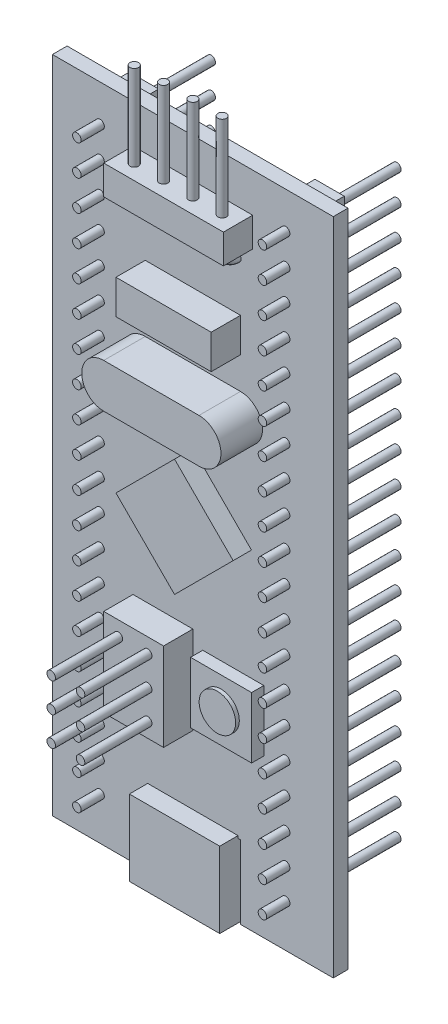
from build123d import *

# Parameters (mm, degrees)
SKETCH_1_W          = 23
SKETCH_1_H          = 54
EXTRUDE_1_DEPTH     = 1.2
SKETCH_2_W          = 2.4
SKETCH_2_H          = 50.6
EXTRUDE_2_DEPTH     = 2.4
SKETCH_3_R          = 0.35
EXTRUDE_3_DEPTH     = 5.5
SKETCH_4_W          = 9.8
SKETCH_4_H          = 2.4
SKETCH_4_W_2        = 4.9
SKETCH_4_H_2        = 7.2
SKETCH_4_W_3        = 7.8
SKETCH_4_H_3        = 2.8
EXTRUDE_4_DEPTH     = 2.4
SKETCH_5_R          = 0.35
EXTRUDE_5_DEPTH     = 7
SKETCH_6_R          = 0.35
SKETCH_7_R          = 0.35
EXTRUDE_6_DEPTH     = 5.5
SKETCH_8_W          = 7.4
SKETCH_8_H          = 6.2
EXTRUDE_7_DEPTH     = 1.5
EXTRUDE_8_DEPTH     = 3.4
SKETCH_10_W         = 5
SKETCH_10_H         = 5
EXTRUDE_9_DEPTH     = 1
SKETCH_11_R         = 1.495071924
EXTRUDE_10_DEPTH    = 0.3
CUT_EXTRUDE_1_DEPTH = 6


with BuildPart() as part:
    # Sketch 1 → Extrude 1 (new body)
    with BuildSketch(Plane.XY):
        with Locations((0.400091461, -3.870786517)):
            Rectangle(SKETCH_1_W, SKETCH_1_H)
    extrude(amount=EXTRUDE_1_DEPTH)

    # Sketch 2 → Extrude 2 (add)
    with BuildSketch(Plane(origin=(0, 0, 0), x_dir=(-1, 0, 0), z_dir=(0, 0, -1))):
        with Locations((-8.000091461, -3.870786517)):
            Rectangle(SKETCH_2_W, SKETCH_2_H)
        with Locations((7.199908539, -3.870786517)):
            Rectangle(SKETCH_2_W, SKETCH_2_H)
    extrude(amount=EXTRUDE_2_DEPTH)

    # Sketch 3 → Extrude 3 (add, symmetric)
    with BuildSketch(Plane(origin=(0, 0, -2.4), x_dir=(-1, 0, 0), z_dir=(0, 0, -1))):
        with Locations((-8.000091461, 20.132856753)):
            Circle(SKETCH_3_R)
        with Locations((7.199908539, 20.132856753)):
            Circle(SKETCH_3_R)
        with Locations((7.199908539, 17.632856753)):
            Circle(SKETCH_3_R)
        with Locations((7.199908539, 15.132856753)):
            Circle(SKETCH_3_R)
        with Locations((7.199908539, 12.632856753)):
            Circle(SKETCH_3_R)
        with Locations((7.199908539, 10.132856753)):
            Circle(SKETCH_3_R)
        with Locations((7.199908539, 7.632856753)):
            Circle(SKETCH_3_R)
        with Locations((7.199908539, 5.132856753)):
            Circle(SKETCH_3_R)
        with Locations((7.199908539, 2.632856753)):
            Circle(SKETCH_3_R)
        with Locations((7.199908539, 0.132856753)):
            Circle(SKETCH_3_R)
        with Locations((7.199908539, -2.367143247)):
            Circle(SKETCH_3_R)
        with Locations((7.199908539, -4.867143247)):
            Circle(SKETCH_3_R)
        with Locations((7.199908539, -7.367143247)):
            Circle(SKETCH_3_R)
        with Locations((7.199908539, -9.867143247)):
            Circle(SKETCH_3_R)
        with Locations((7.199908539, -12.367143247)):
            Circle(SKETCH_3_R)
        with Locations((7.199908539, -14.867143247)):
            Circle(SKETCH_3_R)
        with Locations((7.199908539, -17.367143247)):
            Circle(SKETCH_3_R)
        with Locations((7.199908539, -19.867143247)):
            Circle(SKETCH_3_R)
        with Locations((7.199908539, -22.367143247)):
            Circle(SKETCH_3_R)
        with Locations((7.199908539, -24.867143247)):
            Circle(SKETCH_3_R)
        with Locations((7.199908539, -27.367143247)):
            Circle(SKETCH_3_R)
        with Locations((-8.000091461, 17.632856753)):
            Circle(SKETCH_3_R)
        with Locations((-8.000091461, 15.132856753)):
            Circle(SKETCH_3_R)
        with Locations((-8.000091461, 12.632856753)):
            Circle(SKETCH_3_R)
        with Locations((-8.000091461, 10.132856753)):
            Circle(SKETCH_3_R)
        with Locations((-8.000091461, 7.632856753)):
            Circle(SKETCH_3_R)
        with Locations((-8.000091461, 5.132856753)):
            Circle(SKETCH_3_R)
        with Locations((-8.000091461, 2.632856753)):
            Circle(SKETCH_3_R)
        with Locations((-8.000091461, 0.132856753)):
            Circle(SKETCH_3_R)
        with Locations((-8.000091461, -2.367143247)):
            Circle(SKETCH_3_R)
        with Locations((-8.000091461, -4.867143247)):
            Circle(SKETCH_3_R)
        with Locations((-8.000091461, -7.367143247)):
            Circle(SKETCH_3_R)
        with Locations((-8.000091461, -9.867143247)):
            Circle(SKETCH_3_R)
        with Locations((-8.000091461, -12.367143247)):
            Circle(SKETCH_3_R)
        with Locations((-8.000091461, -14.867143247)):
            Circle(SKETCH_3_R)
        with Locations((-8.000091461, -17.367143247)):
            Circle(SKETCH_3_R)
        with Locations((-8.000091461, -19.867143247)):
            Circle(SKETCH_3_R)
        with Locations((-8.000091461, -22.367143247)):
            Circle(SKETCH_3_R)
        with Locations((-8.000091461, -24.867143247)):
            Circle(SKETCH_3_R)
        with Locations((-8.000091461, -27.367143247)):
            Circle(SKETCH_3_R)
    extrude(amount=EXTRUDE_3_DEPTH, both=True)

    # Sketch 4 → Extrude 4 (add)
    with BuildSketch(Plane.XY.offset(1.2)):
        with Locations((0.400091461, 18.729213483)):
            Rectangle(SKETCH_4_W, SKETCH_4_H)
        with Locations((-2.049908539, -15.470786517)):
            Rectangle(SKETCH_4_W_2, SKETCH_4_H_2)
        with Locations((0.400091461, 10.929213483)):
            Rectangle(SKETCH_4_W_3, SKETCH_4_H_3)
    extrude(amount=EXTRUDE_4_DEPTH)

    # Sketch 5 → Extrude 5 (add)
    with BuildSketch(Plane(origin=(0, 19.929213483, 0), x_dir=(1, 0, 0), z_dir=(0, 1, 0))):
        with Locations((-3.199908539, -2.4)):
            Circle(SKETCH_5_R)
        with Locations((-0.799908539, -2.4)):
            Circle(SKETCH_5_R)
        with Locations((1.600091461, -2.4)):
            Circle(SKETCH_5_R)
        with Locations((4.000091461, -2.4)):
            Circle(SKETCH_5_R)
    extrude(amount=EXTRUDE_5_DEPTH)

    # Sketch 6 → Revolve 1 (revolve)
    with BuildSketch(Plane.XZ.offset(-17.529213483), mode=Mode.PRIVATE) as revolve_1_sk:
        with Locations((-3.199908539, 2.4)):
            Circle(SKETCH_6_R)
        with Locations((-0.799908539, 2.4)):
            Circle(SKETCH_6_R)
        with Locations((1.600091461, 2.4)):
            Circle(SKETCH_6_R)
        with Locations((4.000091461, 2.4)):
            Circle(SKETCH_6_R)
    revolve(revolve_1_sk.sketch.rotate(Axis((-4.499908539, 17.529213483, 1.2), (1, 0, 0)), 45), axis=Axis((-4.499908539, 17.529213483, 1.2), (1, 0, 0)))

    # Sketch 7 → Extrude 6 (add, symmetric)
    with BuildSketch(Plane.XY.offset(3.6)):
        with Locations((-3.299908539, -13.070786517)):
            Circle(SKETCH_7_R)
        with Locations((-0.899908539, -13.070786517)):
            Circle(SKETCH_7_R)
        with Locations((-0.899908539, -15.470786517)):
            Circle(SKETCH_7_R)
        with Locations((-0.899908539, -17.870786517)):
            Circle(SKETCH_7_R)
        with Locations((-3.299908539, -15.470786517)):
            Circle(SKETCH_7_R)
        with Locations((-3.299908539, -17.870786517)):
            Circle(SKETCH_7_R)
    extrude(amount=EXTRUDE_6_DEPTH, both=True)

    # Sketch 8 → Extrude 7 (add)
    with BuildSketch(Plane.XY.offset(1.2)):
        Polygon((-4.399908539, -3.870786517), (0.400091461, 0.929213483), (5.200091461, -3.870786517), (0.400091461, -8.670786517), align=None)
        with Locations((0.400091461, -27.770786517)):
            Rectangle(SKETCH_8_W, SKETCH_8_H)
    extrude(amount=EXTRUDE_7_DEPTH)

    # Sketch 9 → Extrude 8 (add)
    with BuildSketch(Plane.XY.offset(1.2)):
        with BuildLine():
            Line((-3.499908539, 6.929213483), (4.300091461, 6.929213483))
            ThreePointArc((4.300091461, 6.929213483), (6.100091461, 5.129213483), (4.300091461, 3.329213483))
            Line((4.300091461, 3.329213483), (-3.499908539, 3.329213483))
            ThreePointArc((-3.499908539, 3.329213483), (-5.299908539, 5.129213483), (-3.499908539, 6.929213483))
        make_face()
    extrude(amount=EXTRUDE_8_DEPTH)

    # Sketch 10 → Extrude 9 (add)
    with BuildSketch(Plane.XY.offset(1.2)):
        with Locations((3.709299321, -15.470786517)):
            Rectangle(SKETCH_10_W, SKETCH_10_H)
    extrude(amount=EXTRUDE_9_DEPTH)

    # Sketch 11 → Extrude 10 (add)
    with BuildSketch(Plane.XY.offset(2.2)):
        with Locations((3.709299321, -15.470786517)):
            Circle(SKETCH_11_R)
    extrude(amount=EXTRUDE_10_DEPTH)

    # Sketch 12 → Cut-Extrude 1 (cut)
    with BuildSketch(Plane.XZ.offset(30.870786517)):
        Polygon((-3.48398033, 1.2), (-3.48398033, 0), (4.284163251, 0), (4.284163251, 1.2), (4.100091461, 1.2), (4.100091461, 0.727005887), (3.520830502, 0.185516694), (-2.720647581, 0.185516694), (-3.299908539, 0.727005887), (-3.299908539, 1.2), align=None)
    extrude(amount=-CUT_EXTRUDE_1_DEPTH, mode=Mode.SUBTRACT)


solid = part.part
